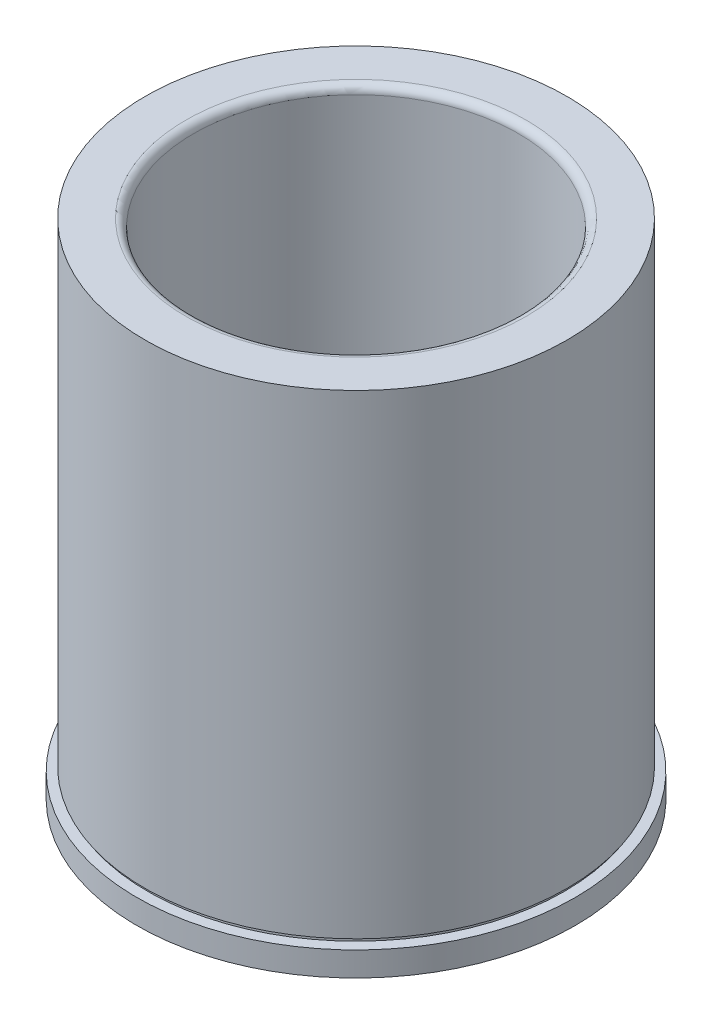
from build123d import *

# Parameters (mm, degrees)
FILLET1_R = 1.524


with BuildPart() as part:
    # Sketch1 → Revolve1 (revolve)
    with BuildSketch(Plane.XY, mode=Mode.PRIVATE) as revolve1_sk:
        Polygon((-31.75635, 114.350690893), (-31.75635, 16.741746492), (-32.572405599, 15.925690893), (-42.8625, 15.925690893), (-42.8625, 20.688190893), (-40.77335, 20.688190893), (-40.77335, 21.450190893), (-41.28135, 21.450190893), (-41.28135, 114.350690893), align=None)
    revolve(revolve1_sk.sketch.rotate(Axis((0, -1000, 0), (0, 1, 0)), 180), axis=Axis((0, -1000, 0), (0, 1, 0)))

    # Fillet1
    fillet1_edges = [part.edges().sort_by_distance(p)[0] for p in [
        (-31.75635, 114.350690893, 0),
    ]]
    fillet(fillet1_edges, radius=FILLET1_R)


solid = part.part
